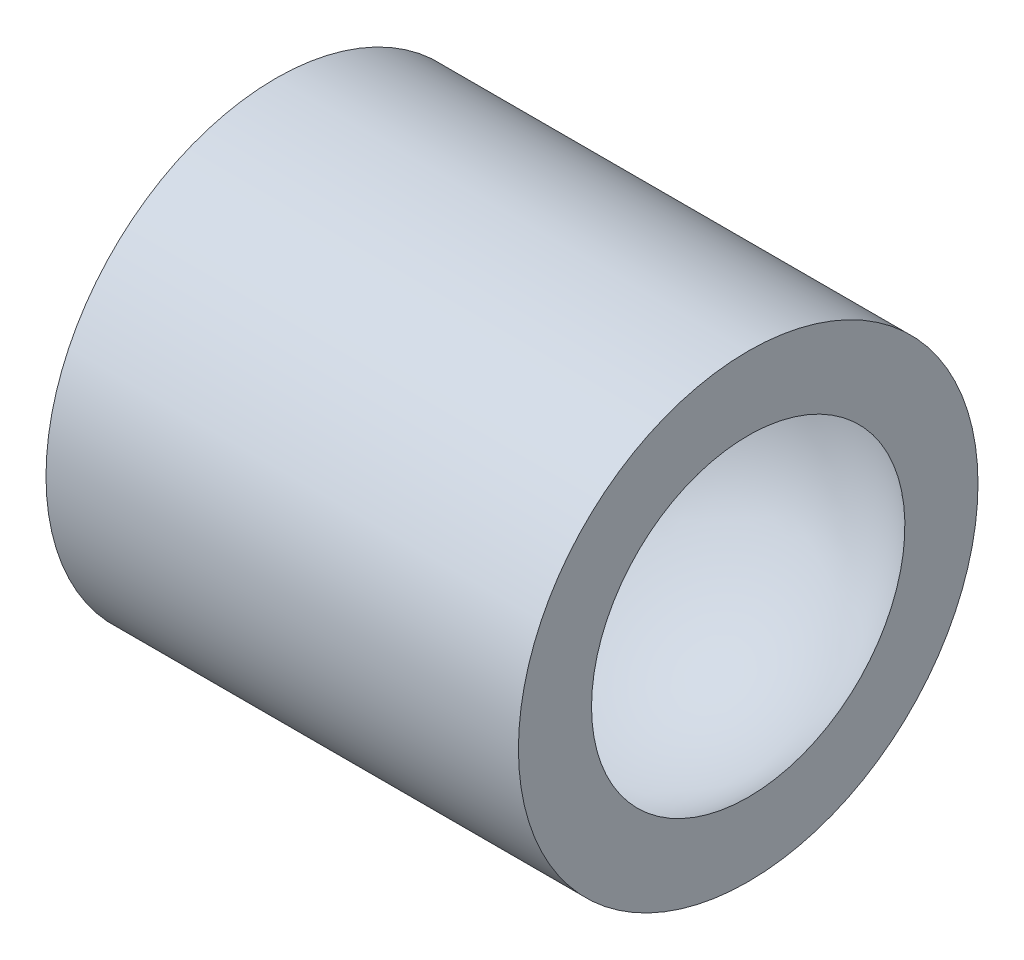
ISO-10303-21;
HEADER;
FILE_DESCRIPTION(('STEP AP214'),'2;1');
FILE_NAME('part.step','',(''),(''),'','','');
FILE_SCHEMA(('AUTOMOTIVE_DESIGN { 1 0 10303 214 1 1 1 1 }'));
ENDSEC;
DATA;
#1=APPLICATION_CONTEXT('core data for automotive mechanical design processes');
#2=APPLICATION_PROTOCOL_DEFINITION('international standard','automotive_design',2000,#1);
#3=PRODUCT_CONTEXT('',#1,'mechanical');
#4=PRODUCT('Part','Part','',(#3));
#5=PRODUCT_RELATED_PRODUCT_CATEGORY('part','',(#4));
#6=PRODUCT_DEFINITION_FORMATION('','',#4);
#7=PRODUCT_DEFINITION_CONTEXT('part definition',#1,'design');
#8=PRODUCT_DEFINITION('design','',#6,#7);
#9=PRODUCT_DEFINITION_SHAPE('','',#8);
#10=(LENGTH_UNIT() NAMED_UNIT(*) SI_UNIT(.MILLI.,.METRE.));
#11=(NAMED_UNIT(*) PLANE_ANGLE_UNIT() SI_UNIT($,.RADIAN.));
#12=(NAMED_UNIT(*) SI_UNIT($,.STERADIAN.) SOLID_ANGLE_UNIT());
#13=UNCERTAINTY_MEASURE_WITH_UNIT(LENGTH_MEASURE(1.E-05),#10,'distance_accuracy_value','');
#14=(GEOMETRIC_REPRESENTATION_CONTEXT(3) GLOBAL_UNCERTAINTY_ASSIGNED_CONTEXT((#13)) GLOBAL_UNIT_ASSIGNED_CONTEXT((#10,
#11,#12)) REPRESENTATION_CONTEXT('',''));
#15=CARTESIAN_POINT('',(0.,0.,0.));
#16=DIRECTION('',(0.,0.,1.));
#17=DIRECTION('',(1.,0.,0.));
#18=AXIS2_PLACEMENT_3D('',#15,#16,#17);
#19=CARTESIAN_POINT('',(0.,0.,0.));
#20=DIRECTION('',(-1.,0.,0.));
#21=DIRECTION('',(0.,-1.,0.));
#22=AXIS2_PLACEMENT_3D('',#19,#20,#21);
#23=SPHERICAL_SURFACE('',#22,50.);
#24=CARTESIAN_POINT('',(33.0718913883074,0.,0.));
#25=DIRECTION('',(-1.,0.,0.));
#26=DIRECTION('',(0.,0.,1.));
#27=AXIS2_PLACEMENT_3D('',#24,#25,#26);
#28=CIRCLE('',#27,37.5);
#29=CARTESIAN_POINT('',(33.0718913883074,0.,37.5));
#30=VERTEX_POINT('',#29);
#31=EDGE_CURVE('E10',#30,#30,#28,.T.);
#32=ORIENTED_EDGE('',*,*,#31,.F.);
#33=EDGE_LOOP('',(#32));
#34=FACE_BOUND('',#33,.T.);
#35=ADVANCED_FACE('F28',(#34),#23,.F.);
#36=CARTESIAN_POINT('',(33.0718913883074,37.5,0.));
#37=DIRECTION('',(-1.,0.,0.));
#38=DIRECTION('',(0.,0.,1.));
#39=AXIS2_PLACEMENT_3D('',#36,#37,#38);
#40=PLANE('',#39);
#41=CARTESIAN_POINT('',(33.0718913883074,0.,0.));
#42=DIRECTION('',(-1.,0.,0.));
#43=DIRECTION('',(0.,0.,1.));
#44=AXIS2_PLACEMENT_3D('',#41,#42,#43);
#45=CIRCLE('',#44,55.);
#46=CARTESIAN_POINT('',(33.0718913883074,0.,55.));
#47=VERTEX_POINT('',#46);
#48=EDGE_CURVE('E34',#47,#47,#45,.T.);
#49=ORIENTED_EDGE('',*,*,#48,.F.);
#50=EDGE_LOOP('',(#49));
#51=FACE_BOUND('',#50,.T.);
#52=ORIENTED_EDGE('',*,*,#31,.T.);
#53=EDGE_LOOP('',(#52));
#54=FACE_BOUND('',#53,.T.);
#55=ADVANCED_FACE('F49',(#51,#54),#40,.F.);
#56=CARTESIAN_POINT('',(0.,0.,0.));
#57=DIRECTION('',(-1.,0.,0.));
#58=DIRECTION('',(0.,0.,1.));
#59=AXIS2_PLACEMENT_3D('',#56,#57,#58);
#60=CYLINDRICAL_SURFACE('',#59,55.);
#61=CARTESIAN_POINT('',(-80.,0.,0.));
#62=DIRECTION('',(-1.,0.,0.));
#63=DIRECTION('',(0.,0.,1.));
#64=AXIS2_PLACEMENT_3D('',#61,#62,#63);
#65=CIRCLE('',#64,55.);
#66=CARTESIAN_POINT('',(-80.,0.,55.));
#67=VERTEX_POINT('',#66);
#68=EDGE_CURVE('E38',#67,#67,#65,.T.);
#69=ORIENTED_EDGE('',*,*,#68,.F.);
#70=EDGE_LOOP('',(#69));
#71=FACE_BOUND('',#70,.T.);
#72=ORIENTED_EDGE('',*,*,#48,.T.);
#73=EDGE_LOOP('',(#72));
#74=FACE_BOUND('',#73,.T.);
#75=ADVANCED_FACE('F47',(#71,#74),#60,.T.);
#76=CARTESIAN_POINT('',(-80.,55.,0.));
#77=DIRECTION('',(1.,0.,0.));
#78=DIRECTION('',(0.,0.,-1.));
#79=AXIS2_PLACEMENT_3D('',#76,#77,#78);
#80=PLANE('',#79);
#81=ORIENTED_EDGE('',*,*,#68,.T.);
#82=EDGE_LOOP('',(#81));
#83=FACE_BOUND('',#82,.T.);
#84=ADVANCED_FACE('F45',(#83),#80,.F.);
#85=CLOSED_SHELL('',(#35,#55,#75,#84));
#86=MANIFOLD_SOLID_BREP('B2',#85);
#87=ADVANCED_BREP_SHAPE_REPRESENTATION('',(#18,#86),#14);
#88=SHAPE_DEFINITION_REPRESENTATION(#9,#87);
ENDSEC;
END-ISO-10303-21;
